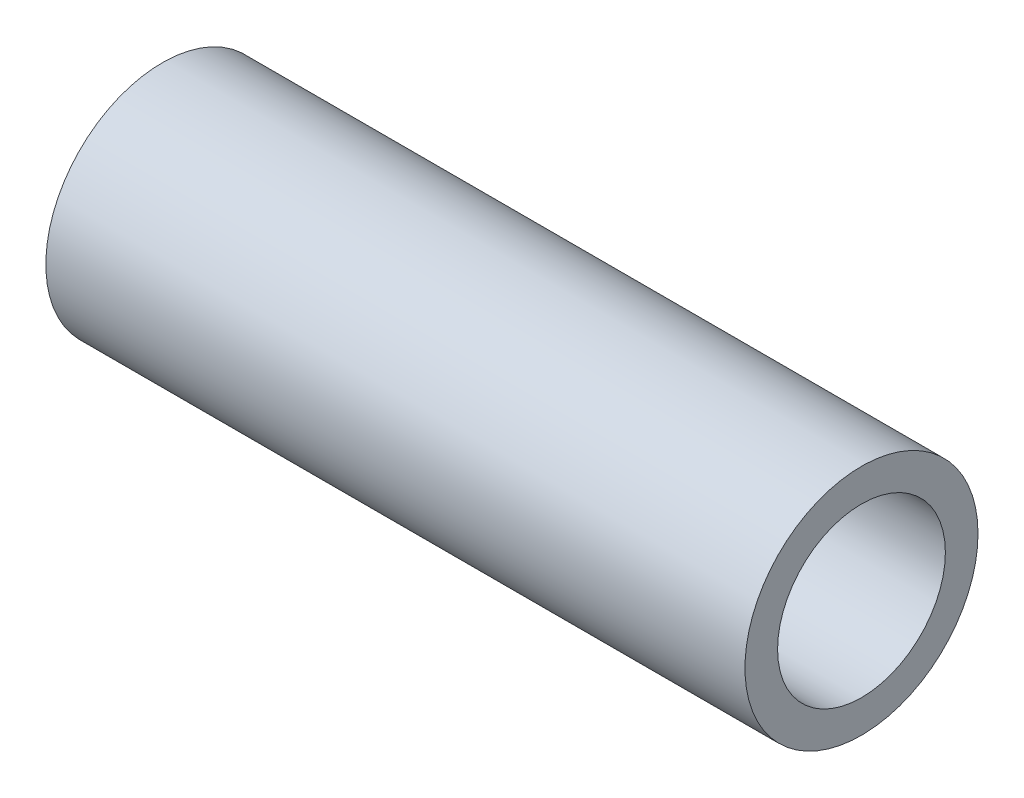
ISO-10303-21;
HEADER;
FILE_DESCRIPTION(('STEP AP214'),'2;1');
FILE_NAME('part.step','',(''),(''),'','','');
FILE_SCHEMA(('AUTOMOTIVE_DESIGN { 1 0 10303 214 1 1 1 1 }'));
ENDSEC;
DATA;
#1=APPLICATION_CONTEXT('core data for automotive mechanical design processes');
#2=APPLICATION_PROTOCOL_DEFINITION('international standard','automotive_design',2000,#1);
#3=PRODUCT_CONTEXT('',#1,'mechanical');
#4=PRODUCT('Part','Part','',(#3));
#5=PRODUCT_RELATED_PRODUCT_CATEGORY('part','',(#4));
#6=PRODUCT_DEFINITION_FORMATION('','',#4);
#7=PRODUCT_DEFINITION_CONTEXT('part definition',#1,'design');
#8=PRODUCT_DEFINITION('design','',#6,#7);
#9=PRODUCT_DEFINITION_SHAPE('','',#8);
#10=(LENGTH_UNIT() NAMED_UNIT(*) SI_UNIT(.MILLI.,.METRE.));
#11=(NAMED_UNIT(*) PLANE_ANGLE_UNIT() SI_UNIT($,.RADIAN.));
#12=(NAMED_UNIT(*) SI_UNIT($,.STERADIAN.) SOLID_ANGLE_UNIT());
#13=UNCERTAINTY_MEASURE_WITH_UNIT(LENGTH_MEASURE(1.E-05),#10,'distance_accuracy_value','');
#14=(GEOMETRIC_REPRESENTATION_CONTEXT(3) GLOBAL_UNCERTAINTY_ASSIGNED_CONTEXT((#13)) GLOBAL_UNIT_ASSIGNED_CONTEXT((#10,
#11,#12)) REPRESENTATION_CONTEXT('',''));
#15=CARTESIAN_POINT('',(0.,0.,0.));
#16=DIRECTION('',(0.,0.,1.));
#17=DIRECTION('',(1.,0.,0.));
#18=AXIS2_PLACEMENT_3D('',#15,#16,#17);
#19=CARTESIAN_POINT('',(0.,0.,0.));
#20=DIRECTION('',(1.,0.,0.));
#21=DIRECTION('',(0.,0.,-1.));
#22=AXIS2_PLACEMENT_3D('',#19,#20,#21);
#23=PLANE('',#22);
#24=CARTESIAN_POINT('',(0.,0.,0.));
#25=DIRECTION('',(1.,0.,0.));
#26=DIRECTION('',(0.,0.,-1.));
#27=AXIS2_PLACEMENT_3D('',#24,#25,#26);
#28=CIRCLE('',#27,5.);
#29=CARTESIAN_POINT('',(0.,0.,-5.));
#30=VERTEX_POINT('',#29);
#31=EDGE_CURVE('E43',#30,#30,#28,.T.);
#32=ORIENTED_EDGE('',*,*,#31,.F.);
#33=EDGE_LOOP('',(#32));
#34=FACE_BOUND('',#33,.T.);
#35=CARTESIAN_POINT('',(0.,0.,0.));
#36=DIRECTION('',(-1.,0.,0.));
#37=DIRECTION('',(0.,-1.,0.));
#38=AXIS2_PLACEMENT_3D('',#35,#36,#37);
#39=CIRCLE('',#38,3.59999999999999);
#40=CARTESIAN_POINT('',(0.,-3.59999999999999,0.));
#41=VERTEX_POINT('',#40);
#42=EDGE_CURVE('E95',#41,#41,#39,.T.);
#43=ORIENTED_EDGE('',*,*,#42,.F.);
#44=EDGE_LOOP('',(#43));
#45=FACE_BOUND('',#44,.T.);
#46=ADVANCED_FACE('F39',(#34,#45),#23,.F.);
#47=CARTESIAN_POINT('',(30.,0.,0.));
#48=DIRECTION('',(1.,0.,0.));
#49=DIRECTION('',(0.,0.,-1.));
#50=AXIS2_PLACEMENT_3D('',#47,#48,#49);
#51=PLANE('',#50);
#52=CARTESIAN_POINT('',(30.,0.,0.));
#53=DIRECTION('',(1.,0.,0.));
#54=DIRECTION('',(0.,0.,-1.));
#55=AXIS2_PLACEMENT_3D('',#52,#53,#54);
#56=CIRCLE('',#55,5.);
#57=CARTESIAN_POINT('',(30.,0.,-5.));
#58=VERTEX_POINT('',#57);
#59=EDGE_CURVE('E11',#58,#58,#56,.T.);
#60=ORIENTED_EDGE('',*,*,#59,.T.);
#61=EDGE_LOOP('',(#60));
#62=FACE_BOUND('',#61,.T.);
#63=CARTESIAN_POINT('',(30.,0.,0.));
#64=DIRECTION('',(-1.,0.,0.));
#65=DIRECTION('',(0.,-1.,0.));
#66=AXIS2_PLACEMENT_3D('',#63,#64,#65);
#67=CIRCLE('',#66,3.6);
#68=CARTESIAN_POINT('',(30.,-3.6,0.));
#69=VERTEX_POINT('',#68);
#70=EDGE_CURVE('E91',#69,#69,#67,.T.);
#71=ORIENTED_EDGE('',*,*,#70,.T.);
#72=EDGE_LOOP('',(#71));
#73=FACE_BOUND('',#72,.T.);
#74=ADVANCED_FACE('F69',(#62,#73),#51,.T.);
#75=CARTESIAN_POINT('',(30.,0.,0.));
#76=DIRECTION('',(-1.,0.,0.));
#77=DIRECTION('',(0.,0.,1.));
#78=AXIS2_PLACEMENT_3D('',#75,#76,#77);
#79=CYLINDRICAL_SURFACE('',#78,5.);
#80=ORIENTED_EDGE('',*,*,#59,.F.);
#81=EDGE_LOOP('',(#80));
#82=FACE_BOUND('',#81,.T.);
#83=ORIENTED_EDGE('',*,*,#31,.T.);
#84=EDGE_LOOP('',(#83));
#85=FACE_BOUND('',#84,.T.);
#86=ADVANCED_FACE('F41',(#82,#85),#79,.T.);
#87=CARTESIAN_POINT('',(-23.6769632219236,0.,0.));
#88=DIRECTION('',(-1.,0.,0.));
#89=DIRECTION('',(0.,-1.,0.));
#90=AXIS2_PLACEMENT_3D('',#87,#88,#89);
#91=CYLINDRICAL_SURFACE('',#90,3.6);
#92=CARTESIAN_POINT('',(23.35,0.,0.));
#93=DIRECTION('',(-1.,0.,0.));
#94=DIRECTION('',(0.,-1.,0.));
#95=AXIS2_PLACEMENT_3D('',#92,#93,#94);
#96=CIRCLE('',#95,3.6);
#97=CARTESIAN_POINT('',(23.35,-3.6,0.));
#98=VERTEX_POINT('',#97);
#99=EDGE_CURVE('E88',#98,#98,#96,.T.);
#100=ORIENTED_EDGE('',*,*,#99,.T.);
#101=EDGE_LOOP('',(#100));
#102=FACE_BOUND('',#101,.T.);
#103=ORIENTED_EDGE('',*,*,#70,.F.);
#104=EDGE_LOOP('',(#103));
#105=FACE_BOUND('',#104,.T.);
#106=ADVANCED_FACE('F65',(#102,#105),#91,.F.);
#107=CARTESIAN_POINT('',(23.35,0.,0.));
#108=DIRECTION('',(1.,0.,0.));
#109=DIRECTION('',(0.,1.,0.));
#110=AXIS2_PLACEMENT_3D('',#107,#108,#109);
#111=CONICAL_SURFACE('',#110,3.6,0.942477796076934);
#112=CARTESIAN_POINT('',(20.7344468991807,0.,0.));
#113=VERTEX_POINT('',#112);
#114=VERTEX_LOOP('',#113);
#115=FACE_BOUND('',#114,.T.);
#116=ORIENTED_EDGE('',*,*,#99,.F.);
#117=EDGE_LOOP('',(#116));
#118=FACE_BOUND('',#117,.T.);
#119=ADVANCED_FACE('F56',(#115,#118),#111,.F.);
#120=CARTESIAN_POINT('',(9.26555310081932,0.,0.));
#121=DIRECTION('',(-1.,0.,0.));
#122=DIRECTION('',(0.,-1.,0.));
#123=AXIS2_PLACEMENT_3D('',#120,#121,#122);
#124=CONICAL_SURFACE('',#123,0.,0.942477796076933);
#125=CARTESIAN_POINT('',(6.65,0.,0.));
#126=DIRECTION('',(-1.,0.,0.));
#127=DIRECTION('',(0.,-1.,0.));
#128=AXIS2_PLACEMENT_3D('',#125,#126,#127);
#129=CIRCLE('',#128,3.59999999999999);
#130=CARTESIAN_POINT('',(6.65,-3.59999999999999,0.));
#131=VERTEX_POINT('',#130);
#132=EDGE_CURVE('E100',#131,#131,#129,.T.);
#133=ORIENTED_EDGE('',*,*,#132,.T.);
#134=EDGE_LOOP('',(#133));
#135=FACE_BOUND('',#134,.T.);
#136=CARTESIAN_POINT('',(9.26555310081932,0.,0.));
#137=VERTEX_POINT('',#136);
#138=VERTEX_LOOP('',#137);
#139=FACE_BOUND('',#138,.T.);
#140=ADVANCED_FACE('F53',(#135,#139),#124,.F.);
#141=CARTESIAN_POINT('',(-23.6769632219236,0.,0.));
#142=DIRECTION('',(-1.,0.,0.));
#143=DIRECTION('',(0.,-1.,0.));
#144=AXIS2_PLACEMENT_3D('',#141,#142,#143);
#145=CYLINDRICAL_SURFACE('',#144,3.59999999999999);
#146=ORIENTED_EDGE('',*,*,#42,.T.);
#147=EDGE_LOOP('',(#146));
#148=FACE_BOUND('',#147,.T.);
#149=ORIENTED_EDGE('',*,*,#132,.F.);
#150=EDGE_LOOP('',(#149));
#151=FACE_BOUND('',#150,.T.);
#152=ADVANCED_FACE('F55',(#148,#151),#145,.F.);
#153=CLOSED_SHELL('',(#46,#74,#86,#106,#119,#140,#152));
#154=MANIFOLD_SOLID_BREP('B2',#153);
#155=ADVANCED_BREP_SHAPE_REPRESENTATION('',(#18,#154),#14);
#156=SHAPE_DEFINITION_REPRESENTATION(#9,#155);
ENDSEC;
END-ISO-10303-21;
